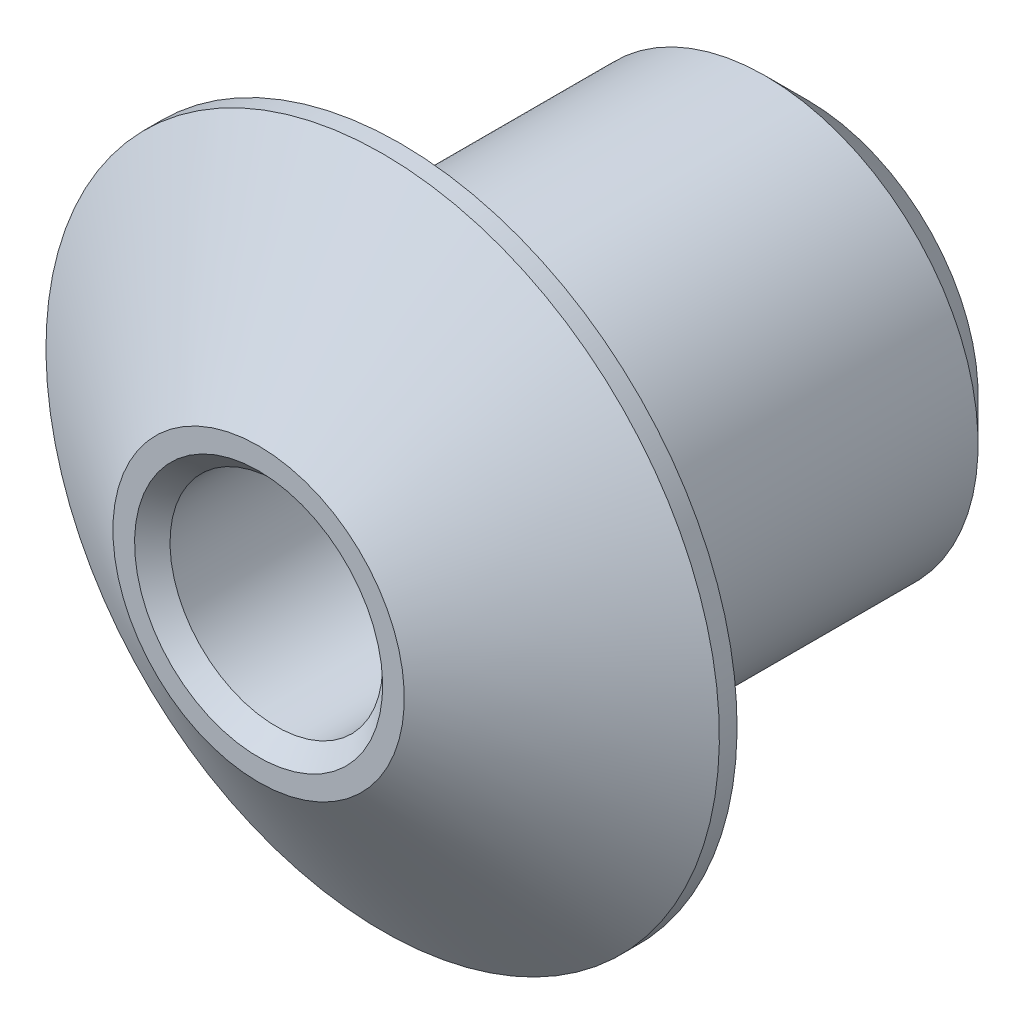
ISO-10303-21;
HEADER;
FILE_DESCRIPTION(('STEP AP214'),'2;1');
FILE_NAME('part.step','',(''),(''),'','','');
FILE_SCHEMA(('AUTOMOTIVE_DESIGN { 1 0 10303 214 1 1 1 1 }'));
ENDSEC;
DATA;
#1=APPLICATION_CONTEXT('core data for automotive mechanical design processes');
#2=APPLICATION_PROTOCOL_DEFINITION('international standard','automotive_design',2000,#1);
#3=PRODUCT_CONTEXT('',#1,'mechanical');
#4=PRODUCT('Part','Part','',(#3));
#5=PRODUCT_RELATED_PRODUCT_CATEGORY('part','',(#4));
#6=PRODUCT_DEFINITION_FORMATION('','',#4);
#7=PRODUCT_DEFINITION_CONTEXT('part definition',#1,'design');
#8=PRODUCT_DEFINITION('design','',#6,#7);
#9=PRODUCT_DEFINITION_SHAPE('','',#8);
#10=(LENGTH_UNIT() NAMED_UNIT(*) SI_UNIT(.MILLI.,.METRE.));
#11=(NAMED_UNIT(*) PLANE_ANGLE_UNIT() SI_UNIT($,.RADIAN.));
#12=(NAMED_UNIT(*) SI_UNIT($,.STERADIAN.) SOLID_ANGLE_UNIT());
#13=UNCERTAINTY_MEASURE_WITH_UNIT(LENGTH_MEASURE(1.E-05),#10,'distance_accuracy_value','');
#14=(GEOMETRIC_REPRESENTATION_CONTEXT(3) GLOBAL_UNCERTAINTY_ASSIGNED_CONTEXT((#13)) GLOBAL_UNIT_ASSIGNED_CONTEXT((#10,
#11,#12)) REPRESENTATION_CONTEXT('',''));
#15=CARTESIAN_POINT('',(0.,0.,0.));
#16=DIRECTION('',(0.,0.,1.));
#17=DIRECTION('',(1.,0.,0.));
#18=AXIS2_PLACEMENT_3D('',#15,#16,#17);
#19=CARTESIAN_POINT('',(0.,0.,-6.));
#20=DIRECTION('',(0.,0.,1.));
#21=DIRECTION('',(0.,-1.,0.));
#22=AXIS2_PLACEMENT_3D('',#19,#20,#21);
#23=CONICAL_SURFACE('',#22,3.,0.872664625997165);
#24=CARTESIAN_POINT('',(2.,2.80471756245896,-5.62679362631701));
#25=CARTESIAN_POINT('',(2.,2.73396986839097,-5.6751166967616));
#26=CARTESIAN_POINT('',(2.,2.66294219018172,-5.72303608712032));
#27=CARTESIAN_POINT('',(2.,2.52019715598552,-5.8178659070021));
#28=CARTESIAN_POINT('',(2.,2.44847966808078,-5.86477613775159));
#29=CARTESIAN_POINT('',(2.,2.30375564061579,-5.95768619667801));
#30=CARTESIAN_POINT('',(2.,2.23074362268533,-6.00367751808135));
#31=CARTESIAN_POINT('',(2.,2.0837722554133,-6.09411502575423));
#32=CARTESIAN_POINT('',(2.,2.00981296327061,-6.13856130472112));
#33=CARTESIAN_POINT('',(2.,1.85599749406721,-6.22831307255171));
#34=CARTESIAN_POINT('',(2.,1.77606682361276,-6.2734915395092));
#35=CARTESIAN_POINT('',(2.,1.6146904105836,-6.36105190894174));
#36=CARTESIAN_POINT('',(2.,1.53324484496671,-6.4034341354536));
#37=CARTESIAN_POINT('',(2.,1.36876230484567,-6.48447917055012));
#38=CARTESIAN_POINT('',(2.,1.28572983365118,-6.52315104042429));
#39=CARTESIAN_POINT('',(2.,1.11764806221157,-6.59578804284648));
#40=CARTESIAN_POINT('',(2.,1.03259966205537,-6.6297552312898));
#41=CARTESIAN_POINT('',(2.,0.864533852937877,-6.69007539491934));
#42=CARTESIAN_POINT('',(2.,0.781623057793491,-6.71672121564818));
#43=CARTESIAN_POINT('',(2.,0.613855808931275,-6.76308753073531));
#44=CARTESIAN_POINT('',(2.,0.528999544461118,-6.78280869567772));
#45=CARTESIAN_POINT('',(2.,0.359526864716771,-6.81358148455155));
#46=CARTESIAN_POINT('',(2.,0.27494250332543,-6.82480568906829));
#47=CARTESIAN_POINT('',(2.,0.105054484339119,-6.83828208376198));
#48=CARTESIAN_POINT('',(2.,0.0197509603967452,-6.84053590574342));
#49=CARTESIAN_POINT('',(2.,-0.142921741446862,-6.83607840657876));
#50=CARTESIAN_POINT('',(2.,-0.220314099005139,-6.83015563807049));
#51=CARTESIAN_POINT('',(2.,-0.374206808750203,-6.81117313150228));
#52=CARTESIAN_POINT('',(2.,-0.450707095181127,-6.79811287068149));
#53=CARTESIAN_POINT('',(2.,-0.60406442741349,-6.76535582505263));
#54=CARTESIAN_POINT('',(2.,-0.680890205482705,-6.74551522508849));
#55=CARTESIAN_POINT('',(2.,-0.83287627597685,-6.70037508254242));
#56=CARTESIAN_POINT('',(2.,-0.908036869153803,-6.6750765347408));
#57=CARTESIAN_POINT('',(2.,-1.12321598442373,-6.59549140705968));
#58=CARTESIAN_POINT('',(2.,-1.26111796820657,-6.53551569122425));
#59=CARTESIAN_POINT('',(2.,-1.53207254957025,-6.40534956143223));
#60=CARTESIAN_POINT('',(2.,-1.6651177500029,-6.33514431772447));
#61=CARTESIAN_POINT('',(2.,-1.928255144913,-6.18759917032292));
#62=CARTESIAN_POINT('',(2.,-2.05832345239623,-6.11021710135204));
#63=CARTESIAN_POINT('',(2.,-2.31553327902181,-5.95094559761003));
#64=CARTESIAN_POINT('',(2.,-2.44267647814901,-5.86905884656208));
#65=CARTESIAN_POINT('',(2.,-2.68110139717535,-5.71119615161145));
#66=CARTESIAN_POINT('',(2.,-2.79260172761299,-5.6355485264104));
#67=CARTESIAN_POINT('',(2.,-3.01430589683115,-5.48234503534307));
#68=CARTESIAN_POINT('',(2.,-3.12450952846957,-5.40478887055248));
#69=CARTESIAN_POINT('',(2.,-3.3424096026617,-5.24928281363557));
#70=CARTESIAN_POINT('',(2.,-3.45011984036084,-5.17135219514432));
#71=CARTESIAN_POINT('',(2.,-3.66469498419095,-5.01439381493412));
#72=CARTESIAN_POINT('',(2.,-3.77156010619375,-4.93536634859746));
#73=CARTESIAN_POINT('',(2.,-3.87811170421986,-4.85592436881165));
#74=B_SPLINE_CURVE_WITH_KNOTS('',3,(#24,#25,#26,#27,#28,#29,#30,#31,#32,#33,#34,#35,#36,#37,#38,
#39,#40,#41,#42,#43,#44,#45,#46,#47,#48,#49,#50,#51,#52,#53,#54,#55,#56,#57,#58,#59,#60,#61,#62,
#63,#64,#65,#66,#67,#68,#69,#70,#71,#72,#73),.UNSPECIFIED.,.F.,.F.,(4,2,2,2,2,2,2,2,2,2,2,2,2,2,
2,2,2,2,2,2,2,2,2,2,4),(0.,0.257031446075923,0.51411306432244,0.772967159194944,
1.03180569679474,1.30720772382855,1.58257778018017,1.85725724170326,2.13181628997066,
2.39283817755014,2.6538347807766,2.90937650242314,3.16487173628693,3.39737401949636,
3.62989333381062,3.86768683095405,4.10543702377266,4.55583321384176,5.00688896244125,
5.46078660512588,5.91441670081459,6.31861250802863,6.72287203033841,7.12170276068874,
7.5204280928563),.UNSPECIFIED.);
#75=CARTESIAN_POINT('',(2.,1.15470053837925,-6.57948130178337));
#76=VERTEX_POINT('',#75);
#77=CARTESIAN_POINT('',(2.,-1.15470053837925,-6.57948130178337));
#78=VERTEX_POINT('',#77);
#79=EDGE_CURVE('E142',#76,#78,#74,.T.);
#80=ORIENTED_EDGE('',*,*,#79,.T.);
#81=CARTESIAN_POINT('',(2.0002,-1.15458506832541,-6.57938440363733));
#82=CARTESIAN_POINT('',(1.93287475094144,-1.19345531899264,-6.61198832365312));
#83=CARTESIAN_POINT('',(1.86472971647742,-1.23279887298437,-6.64255441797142));
#84=CARTESIAN_POINT('',(1.72660712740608,-1.31254398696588,-6.6984348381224));
#85=CARTESIAN_POINT('',(1.65662434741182,-1.3529485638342,-6.72373181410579));
#86=CARTESIAN_POINT('',(1.51571866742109,-1.4343004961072,-6.76746867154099));
#87=CARTESIAN_POINT('',(1.44481025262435,-1.47523948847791,-6.78596924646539));
#88=CARTESIAN_POINT('',(1.30186028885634,-1.55777168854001,-6.81514647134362));
#89=CARTESIAN_POINT('',(1.22982023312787,-1.59936403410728,-6.82583267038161));
#90=CARTESIAN_POINT('',(1.0839081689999,-1.68360640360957,-6.83863007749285));
#91=CARTESIAN_POINT('',(1.01002594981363,-1.7262623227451,-6.84059082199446));
#92=CARTESIAN_POINT('',(0.862481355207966,-1.81144723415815,-6.83533603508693));
#93=CARTESIAN_POINT('',(0.78881909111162,-1.8539761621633,-6.82811645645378));
#94=CARTESIAN_POINT('',(0.642524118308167,-1.93843960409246,-6.80516008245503));
#95=CARTESIAN_POINT('',(0.569891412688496,-1.98037411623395,-6.7894232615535));
#96=CARTESIAN_POINT('',(0.42609953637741,-2.06339239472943,-6.75064484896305));
#97=CARTESIAN_POINT('',(0.354941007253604,-2.1044757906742,-6.72760014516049));
#98=CARTESIAN_POINT('',(0.236290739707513,-2.17297855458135,-6.68371678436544));
#99=CARTESIAN_POINT('',(0.188354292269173,-2.20065467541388,-6.66444042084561));
#100=CARTESIAN_POINT('',(0.0934234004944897,-2.2554630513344,-6.62356259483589));
#101=CARTESIAN_POINT('',(0.0464262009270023,-2.28259689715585,-6.60196969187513));
#102=CARTESIAN_POINT('',(-0.000200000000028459,-2.30951654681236,-6.57938440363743));
#103=B_SPLINE_CURVE_WITH_KNOTS('',3,(#81,#82,#83,#84,#85,#86,#87,#88,#89,#90,#91,#92,#93,#94,
#95,#96,#97,#98,#99,#100,#101,#102),.UNSPECIFIED.,.F.,.F.,(4,2,2,2,2,2,2,2,2,2,4),(0.,
0.253000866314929,0.506822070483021,0.758318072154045,1.00950623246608,1.2650095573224,
1.5206255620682,1.77624233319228,2.0319681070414,2.20775392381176,2.38291123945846),.UNSPECIFIED.);
#104=CARTESIAN_POINT('',(0.,-2.30940107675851,-6.57948130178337));
#105=VERTEX_POINT('',#104);
#106=EDGE_CURVE('E104',#78,#105,#103,.T.);
#107=ORIENTED_EDGE('',*,*,#106,.T.);
#108=CARTESIAN_POINT('',(0.0002,-2.30951654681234,-6.57938440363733));
#109=CARTESIAN_POINT('',(-0.0671252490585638,-2.27064629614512,-6.61198832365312));
#110=CARTESIAN_POINT('',(-0.135270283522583,-2.23130274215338,-6.64255441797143));
#111=CARTESIAN_POINT('',(-0.273392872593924,-2.15155762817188,-6.6984348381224));
#112=CARTESIAN_POINT('',(-0.343375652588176,-2.11115305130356,-6.72373181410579));
#113=CARTESIAN_POINT('',(-0.484281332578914,-2.02980111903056,-6.76746867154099));
#114=CARTESIAN_POINT('',(-0.555189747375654,-1.98886212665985,-6.78596924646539));
#115=CARTESIAN_POINT('',(-0.698139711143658,-1.90632992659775,-6.81514647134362));
#116=CARTESIAN_POINT('',(-0.770179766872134,-1.86473758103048,-6.82583267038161));
#117=CARTESIAN_POINT('',(-0.9160918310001,-1.78049521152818,-6.83863007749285));
#118=CARTESIAN_POINT('',(-0.98997405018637,-1.73783929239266,-6.84059082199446));
#119=CARTESIAN_POINT('',(-1.13751864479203,-1.6526543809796,-6.83533603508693));
#120=CARTESIAN_POINT('',(-1.21118090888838,-1.61012545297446,-6.82811645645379));
#121=CARTESIAN_POINT('',(-1.35747588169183,-1.5256620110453,-6.80516008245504));
#122=CARTESIAN_POINT('',(-1.43010858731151,-1.48372749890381,-6.7894232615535));
#123=CARTESIAN_POINT('',(-1.57390046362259,-1.40070922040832,-6.75064484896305));
#124=CARTESIAN_POINT('',(-1.64505899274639,-1.35962582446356,-6.72760014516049));
#125=CARTESIAN_POINT('',(-1.76370926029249,-1.2911230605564,-6.68371678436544));
#126=CARTESIAN_POINT('',(-1.81164570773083,-1.26344693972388,-6.66444042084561));
#127=CARTESIAN_POINT('',(-1.90657659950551,-1.20863856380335,-6.62356259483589));
#128=CARTESIAN_POINT('',(-1.953573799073,-1.18150471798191,-6.60196969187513));
#129=CARTESIAN_POINT('',(-2.00020000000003,-1.1545850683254,-6.57938440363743));
#130=B_SPLINE_CURVE_WITH_KNOTS('',3,(#108,#109,#110,#111,#112,#113,#114,#115,#116,#117,#118,
#119,#120,#121,#122,#123,#124,#125,#126,#127,#128,#129),.UNSPECIFIED.,.F.,.F.,(4,2,2,2,2,2,2,2,
2,2,4),(0.,0.253000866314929,0.506822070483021,0.758318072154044,1.00950623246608,
1.2650095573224,1.52062556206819,1.77624233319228,2.0319681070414,2.20775392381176,
2.38291123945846),.UNSPECIFIED.);
#131=CARTESIAN_POINT('',(-2.,-1.15470053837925,-6.57948130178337));
#132=VERTEX_POINT('',#131);
#133=EDGE_CURVE('E153',#105,#132,#130,.T.);
#134=ORIENTED_EDGE('',*,*,#133,.T.);
#135=CARTESIAN_POINT('',(-2.,2.80471756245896,-5.62679362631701));
#136=CARTESIAN_POINT('',(-2.,2.73396986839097,-5.6751166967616));
#137=CARTESIAN_POINT('',(-2.,2.66294219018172,-5.72303608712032));
#138=CARTESIAN_POINT('',(-2.,2.52019715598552,-5.8178659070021));
#139=CARTESIAN_POINT('',(-2.,2.44847966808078,-5.86477613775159));
#140=CARTESIAN_POINT('',(-2.,2.30375564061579,-5.95768619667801));
#141=CARTESIAN_POINT('',(-2.,2.23074362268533,-6.00367751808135));
#142=CARTESIAN_POINT('',(-2.,2.0837722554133,-6.09411502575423));
#143=CARTESIAN_POINT('',(-2.,2.00981296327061,-6.13856130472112));
#144=CARTESIAN_POINT('',(-2.,1.85599749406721,-6.22831307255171));
#145=CARTESIAN_POINT('',(-2.,1.77606682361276,-6.2734915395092));
#146=CARTESIAN_POINT('',(-2.,1.6146904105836,-6.36105190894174));
#147=CARTESIAN_POINT('',(-2.,1.53324484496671,-6.4034341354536));
#148=CARTESIAN_POINT('',(-2.,1.36876230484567,-6.48447917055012));
#149=CARTESIAN_POINT('',(-2.,1.28572983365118,-6.52315104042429));
#150=CARTESIAN_POINT('',(-2.,1.11764806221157,-6.59578804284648));
#151=CARTESIAN_POINT('',(-2.,1.03259966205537,-6.6297552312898));
#152=CARTESIAN_POINT('',(-2.,0.864533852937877,-6.69007539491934));
#153=CARTESIAN_POINT('',(-2.,0.781623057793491,-6.71672121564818));
#154=CARTESIAN_POINT('',(-2.,0.613855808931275,-6.76308753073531));
#155=CARTESIAN_POINT('',(-2.,0.528999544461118,-6.78280869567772));
#156=CARTESIAN_POINT('',(-2.,0.359526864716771,-6.81358148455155));
#157=CARTESIAN_POINT('',(-2.,0.27494250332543,-6.82480568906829));
#158=CARTESIAN_POINT('',(-2.,0.105054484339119,-6.83828208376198));
#159=CARTESIAN_POINT('',(-2.,0.0197509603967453,-6.84053590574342));
#160=CARTESIAN_POINT('',(-2.,-0.142921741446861,-6.83607840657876));
#161=CARTESIAN_POINT('',(-2.,-0.220314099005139,-6.83015563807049));
#162=CARTESIAN_POINT('',(-2.,-0.374206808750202,-6.81117313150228));
#163=CARTESIAN_POINT('',(-2.,-0.450707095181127,-6.79811287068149));
#164=CARTESIAN_POINT('',(-2.,-0.60406442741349,-6.76535582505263));
#165=CARTESIAN_POINT('',(-2.,-0.680890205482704,-6.7455152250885));
#166=CARTESIAN_POINT('',(-2.,-0.832876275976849,-6.70037508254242));
#167=CARTESIAN_POINT('',(-2.,-0.908036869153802,-6.6750765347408));
#168=CARTESIAN_POINT('',(-2.,-1.12321598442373,-6.59549140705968));
#169=CARTESIAN_POINT('',(-2.,-1.26111796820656,-6.53551569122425));
#170=CARTESIAN_POINT('',(-2.,-1.53207254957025,-6.40534956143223));
#171=CARTESIAN_POINT('',(-2.,-1.6651177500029,-6.33514431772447));
#172=CARTESIAN_POINT('',(-2.,-1.928255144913,-6.18759917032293));
#173=CARTESIAN_POINT('',(-2.,-2.05832345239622,-6.11021710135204));
#174=CARTESIAN_POINT('',(-2.,-2.3155332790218,-5.95094559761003));
#175=CARTESIAN_POINT('',(-2.,-2.442676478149,-5.86905884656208));
#176=CARTESIAN_POINT('',(-2.,-2.68110139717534,-5.71119615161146));
#177=CARTESIAN_POINT('',(-2.,-2.79260172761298,-5.6355485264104));
#178=CARTESIAN_POINT('',(-2.,-3.01430589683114,-5.48234503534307));
#179=CARTESIAN_POINT('',(-2.,-3.12450952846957,-5.40478887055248));
#180=CARTESIAN_POINT('',(-2.,-3.3424096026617,-5.24928281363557));
#181=CARTESIAN_POINT('',(-2.,-3.45011984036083,-5.17135219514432));
#182=CARTESIAN_POINT('',(-2.,-3.66469498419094,-5.01439381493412));
#183=CARTESIAN_POINT('',(-2.,-3.77156010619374,-4.93536634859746));
#184=CARTESIAN_POINT('',(-2.,-3.87811170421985,-4.85592436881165));
#185=B_SPLINE_CURVE_WITH_KNOTS('',3,(#135,#136,#137,#138,#139,#140,#141,#142,#143,#144,#145,
#146,#147,#148,#149,#150,#151,#152,#153,#154,#155,#156,#157,#158,#159,#160,#161,#162,#163,#164,
#165,#166,#167,#168,#169,#170,#171,#172,#173,#174,#175,#176,#177,#178,#179,#180,#181,#182,#183,
#184),.UNSPECIFIED.,.F.,.F.,(4,2,2,2,2,2,2,2,2,2,2,2,2,2,2,2,2,2,2,2,2,2,2,2,4),(0.,
0.257031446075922,0.51411306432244,0.772967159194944,1.03180569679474,1.30720772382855,
1.58257778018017,1.85725724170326,2.13181628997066,2.39283817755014,2.6538347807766,
2.90937650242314,3.16487173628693,3.39737401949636,3.62989333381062,3.86768683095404,
4.10543702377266,4.55583321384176,5.00688896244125,5.46078660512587,5.91441670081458,
6.31861250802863,6.72287203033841,7.12170276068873,7.52042809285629),.UNSPECIFIED.);
#186=CARTESIAN_POINT('',(-2.,1.15470053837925,-6.57948130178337));
#187=VERTEX_POINT('',#186);
#188=EDGE_CURVE('E78',#132,#187,#185,.F.);
#189=ORIENTED_EDGE('',*,*,#188,.T.);
#190=CARTESIAN_POINT('',(-2.0002,1.15458506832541,-6.57938440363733));
#191=CARTESIAN_POINT('',(-1.93287475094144,1.19345531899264,-6.61198832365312));
#192=CARTESIAN_POINT('',(-1.86472971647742,1.23279887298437,-6.64255441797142));
#193=CARTESIAN_POINT('',(-1.72660712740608,1.31254398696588,-6.6984348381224));
#194=CARTESIAN_POINT('',(-1.65662434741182,1.3529485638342,-6.72373181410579));
#195=CARTESIAN_POINT('',(-1.51571866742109,1.4343004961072,-6.76746867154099));
#196=CARTESIAN_POINT('',(-1.44481025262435,1.47523948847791,-6.78596924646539));
#197=CARTESIAN_POINT('',(-1.30186028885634,1.55777168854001,-6.81514647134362));
#198=CARTESIAN_POINT('',(-1.22982023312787,1.59936403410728,-6.82583267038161));
#199=CARTESIAN_POINT('',(-1.0839081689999,1.68360640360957,-6.83863007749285));
#200=CARTESIAN_POINT('',(-1.01002594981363,1.7262623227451,-6.84059082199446));
#201=CARTESIAN_POINT('',(-0.862481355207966,1.81144723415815,-6.83533603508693));
#202=CARTESIAN_POINT('',(-0.78881909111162,1.8539761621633,-6.82811645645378));
#203=CARTESIAN_POINT('',(-0.642524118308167,1.93843960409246,-6.80516008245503));
#204=CARTESIAN_POINT('',(-0.569891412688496,1.98037411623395,-6.7894232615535));
#205=CARTESIAN_POINT('',(-0.42609953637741,2.06339239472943,-6.75064484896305));
#206=CARTESIAN_POINT('',(-0.354941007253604,2.1044757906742,-6.72760014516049));
#207=CARTESIAN_POINT('',(-0.236290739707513,2.17297855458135,-6.68371678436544));
#208=CARTESIAN_POINT('',(-0.188354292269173,2.20065467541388,-6.66444042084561));
#209=CARTESIAN_POINT('',(-0.0934234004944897,2.2554630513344,-6.62356259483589));
#210=CARTESIAN_POINT('',(-0.0464262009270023,2.28259689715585,-6.60196969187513));
#211=CARTESIAN_POINT('',(0.000200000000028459,2.30951654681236,-6.57938440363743));
#212=B_SPLINE_CURVE_WITH_KNOTS('',3,(#190,#191,#192,#193,#194,#195,#196,#197,#198,#199,#200,
#201,#202,#203,#204,#205,#206,#207,#208,#209,#210,#211),.UNSPECIFIED.,.F.,.F.,(4,2,2,2,2,2,2,2,
2,2,4),(0.,0.253000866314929,0.506822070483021,0.758318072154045,1.00950623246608,
1.2650095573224,1.5206255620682,1.77624233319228,2.0319681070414,2.20775392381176,
2.38291123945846),.UNSPECIFIED.);
#213=CARTESIAN_POINT('',(0.,2.30940107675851,-6.57948130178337));
#214=VERTEX_POINT('',#213);
#215=EDGE_CURVE('E29',#187,#214,#212,.T.);
#216=ORIENTED_EDGE('',*,*,#215,.T.);
#217=CARTESIAN_POINT('',(-0.0002,2.30951654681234,-6.57938440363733));
#218=CARTESIAN_POINT('',(0.0671252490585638,2.27064629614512,-6.61198832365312));
#219=CARTESIAN_POINT('',(0.135270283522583,2.23130274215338,-6.64255441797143));
#220=CARTESIAN_POINT('',(0.273392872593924,2.15155762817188,-6.6984348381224));
#221=CARTESIAN_POINT('',(0.343375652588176,2.11115305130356,-6.72373181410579));
#222=CARTESIAN_POINT('',(0.484281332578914,2.02980111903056,-6.76746867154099));
#223=CARTESIAN_POINT('',(0.555189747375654,1.98886212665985,-6.78596924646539));
#224=CARTESIAN_POINT('',(0.698139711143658,1.90632992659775,-6.81514647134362));
#225=CARTESIAN_POINT('',(0.770179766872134,1.86473758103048,-6.82583267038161));
#226=CARTESIAN_POINT('',(0.9160918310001,1.78049521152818,-6.83863007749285));
#227=CARTESIAN_POINT('',(0.98997405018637,1.73783929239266,-6.84059082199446));
#228=CARTESIAN_POINT('',(1.13751864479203,1.6526543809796,-6.83533603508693));
#229=CARTESIAN_POINT('',(1.21118090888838,1.61012545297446,-6.82811645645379));
#230=CARTESIAN_POINT('',(1.35747588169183,1.5256620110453,-6.80516008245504));
#231=CARTESIAN_POINT('',(1.43010858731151,1.48372749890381,-6.7894232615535));
#232=CARTESIAN_POINT('',(1.57390046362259,1.40070922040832,-6.75064484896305));
#233=CARTESIAN_POINT('',(1.64505899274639,1.35962582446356,-6.72760014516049));
#234=CARTESIAN_POINT('',(1.76370926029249,1.2911230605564,-6.68371678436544));
#235=CARTESIAN_POINT('',(1.81164570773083,1.26344693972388,-6.66444042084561));
#236=CARTESIAN_POINT('',(1.90657659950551,1.20863856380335,-6.62356259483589));
#237=CARTESIAN_POINT('',(1.953573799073,1.18150471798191,-6.60196969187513));
#238=CARTESIAN_POINT('',(2.00020000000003,1.1545850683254,-6.57938440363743));
#239=B_SPLINE_CURVE_WITH_KNOTS('',3,(#217,#218,#219,#220,#221,#222,#223,#224,#225,#226,#227,
#228,#229,#230,#231,#232,#233,#234,#235,#236,#237,#238),.UNSPECIFIED.,.F.,.F.,(4,2,2,2,2,2,2,2,
2,2,4),(0.,0.253000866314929,0.506822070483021,0.758318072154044,1.00950623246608,
1.2650095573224,1.52062556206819,1.77624233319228,2.0319681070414,2.20775392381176,
2.38291123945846),.UNSPECIFIED.);
#240=EDGE_CURVE('E121',#214,#76,#239,.T.);
#241=ORIENTED_EDGE('',*,*,#240,.T.);
#242=EDGE_LOOP('',(#80,#107,#134,#189,#216,#241));
#243=FACE_BOUND('',#242,.T.);
#244=CARTESIAN_POINT('',(0.,0.,-6.));
#245=DIRECTION('',(0.,0.,-1.));
#246=DIRECTION('',(0.,1.,0.));
#247=AXIS2_PLACEMENT_3D('',#244,#245,#246);
#248=CIRCLE('',#247,3.);
#249=CARTESIAN_POINT('',(0.,3.,-6.));
#250=VERTEX_POINT('',#249);
#251=EDGE_CURVE('E214',#250,#250,#248,.T.);
#252=ORIENTED_EDGE('',*,*,#251,.F.);
#253=EDGE_LOOP('',(#252));
#254=FACE_BOUND('',#253,.T.);
#255=ADVANCED_FACE('F14',(#243,#254),#23,.F.);
#256=CARTESIAN_POINT('',(2.,0.,-11.5));
#257=DIRECTION('',(0.,0.,-1.));
#258=DIRECTION('',(0.,1.,0.));
#259=AXIS2_PLACEMENT_3D('',#256,#257,#258);
#260=PLANE('',#259);
#261=CARTESIAN_POINT('',(0.,0.,-11.5));
#262=DIRECTION('',(0.,0.,-1.));
#263=DIRECTION('',(0.,1.,0.));
#264=AXIS2_PLACEMENT_3D('',#261,#262,#263);
#265=CIRCLE('',#264,4.8);
#266=CARTESIAN_POINT('',(0.,4.8,-11.5));
#267=VERTEX_POINT('',#266);
#268=EDGE_CURVE('E88',#267,#267,#265,.T.);
#269=ORIENTED_EDGE('',*,*,#268,.T.);
#270=EDGE_LOOP('',(#269));
#271=FACE_BOUND('',#270,.T.);
#272=DIRECTION('',(-0.866025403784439,-0.5,0.));
#273=VECTOR('',#272,1.);
#274=CARTESIAN_POINT('',(0.5,2.59807621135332,-11.5));
#275=LINE('',#274,#273);
#276=CARTESIAN_POINT('',(0.,2.30940107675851,-11.5));
#277=VERTEX_POINT('',#276);
#278=CARTESIAN_POINT('',(-2.,1.15470053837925,-11.5));
#279=VERTEX_POINT('',#278);
#280=EDGE_CURVE('E83',#277,#279,#275,.T.);
#281=ORIENTED_EDGE('',*,*,#280,.T.);
#282=DIRECTION('',(0.,-1.,0.));
#283=VECTOR('',#282,1.);
#284=CARTESIAN_POINT('',(-2.,0.,-11.5));
#285=LINE('',#284,#283);
#286=CARTESIAN_POINT('',(-2.,-1.15470053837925,-11.5));
#287=VERTEX_POINT('',#286);
#288=EDGE_CURVE('E9',#279,#287,#285,.T.);
#289=ORIENTED_EDGE('',*,*,#288,.T.);
#290=DIRECTION('',(0.866025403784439,-0.5,0.));
#291=VECTOR('',#290,1.);
#292=CARTESIAN_POINT('',(0.5,-2.59807621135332,-11.5));
#293=LINE('',#292,#291);
#294=CARTESIAN_POINT('',(0.,-2.30940107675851,-11.5));
#295=VERTEX_POINT('',#294);
#296=EDGE_CURVE('E22',#287,#295,#293,.T.);
#297=ORIENTED_EDGE('',*,*,#296,.T.);
#298=DIRECTION('',(0.866025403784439,0.5,0.));
#299=VECTOR('',#298,1.);
#300=CARTESIAN_POINT('',(2.5,-0.866025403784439,-11.5));
#301=LINE('',#300,#299);
#302=CARTESIAN_POINT('',(2.,-1.15470053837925,-11.5));
#303=VERTEX_POINT('',#302);
#304=EDGE_CURVE('E75',#295,#303,#301,.T.);
#305=ORIENTED_EDGE('',*,*,#304,.T.);
#306=DIRECTION('',(0.,1.,0.));
#307=VECTOR('',#306,1.);
#308=CARTESIAN_POINT('',(2.,0.,-11.5));
#309=LINE('',#308,#307);
#310=CARTESIAN_POINT('',(2.,1.15470053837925,-11.5));
#311=VERTEX_POINT('',#310);
#312=EDGE_CURVE('E90',#303,#311,#309,.T.);
#313=ORIENTED_EDGE('',*,*,#312,.T.);
#314=DIRECTION('',(-0.866025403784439,0.5,0.));
#315=VECTOR('',#314,1.);
#316=CARTESIAN_POINT('',(2.5,0.866025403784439,-11.5));
#317=LINE('',#316,#315);
#318=EDGE_CURVE('E85',#311,#277,#317,.T.);
#319=ORIENTED_EDGE('',*,*,#318,.T.);
#320=EDGE_LOOP('',(#281,#289,#297,#305,#313,#319));
#321=FACE_BOUND('',#320,.T.);
#322=ADVANCED_FACE('F81',(#271,#321),#260,.T.);
#323=CARTESIAN_POINT('',(0.,0.,-11.5));
#324=DIRECTION('',(0.,0.,1.));
#325=DIRECTION('',(0.,-1.,0.));
#326=AXIS2_PLACEMENT_3D('',#323,#324,#325);
#327=CONICAL_SURFACE('',#326,4.8,0.785398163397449);
#328=CARTESIAN_POINT('',(0.,0.,-10.3));
#329=DIRECTION('',(0.,0.,-1.));
#330=DIRECTION('',(0.,1.,0.));
#331=AXIS2_PLACEMENT_3D('',#328,#329,#330);
#332=CIRCLE('',#331,6.);
#333=CARTESIAN_POINT('',(0.,6.,-10.3));
#334=VERTEX_POINT('',#333);
#335=EDGE_CURVE('E93',#334,#334,#332,.T.);
#336=ORIENTED_EDGE('',*,*,#335,.T.);
#337=EDGE_LOOP('',(#336));
#338=FACE_BOUND('',#337,.T.);
#339=ORIENTED_EDGE('',*,*,#268,.F.);
#340=EDGE_LOOP('',(#339));
#341=FACE_BOUND('',#340,.T.);
#342=ADVANCED_FACE('F197',(#338,#341),#327,.T.);
#343=CARTESIAN_POINT('',(0.,0.,-11.5));
#344=DIRECTION('',(0.,0.,-1.));
#345=DIRECTION('',(0.,1.,0.));
#346=AXIS2_PLACEMENT_3D('',#343,#344,#345);
#347=CYLINDRICAL_SURFACE('',#346,6.);
#348=CARTESIAN_POINT('',(0.,0.,0.));
#349=DIRECTION('',(0.,0.,-1.));
#350=DIRECTION('',(0.,1.,0.));
#351=AXIS2_PLACEMENT_3D('',#348,#349,#350);
#352=CIRCLE('',#351,6.);
#353=CARTESIAN_POINT('',(0.,6.,0.));
#354=VERTEX_POINT('',#353);
#355=EDGE_CURVE('E231',#354,#354,#352,.T.);
#356=ORIENTED_EDGE('',*,*,#355,.T.);
#357=EDGE_LOOP('',(#356));
#358=FACE_BOUND('',#357,.T.);
#359=ORIENTED_EDGE('',*,*,#335,.F.);
#360=EDGE_LOOP('',(#359));
#361=FACE_BOUND('',#360,.T.);
#362=ADVANCED_FACE('F193',(#358,#361),#347,.T.);
#363=CARTESIAN_POINT('',(6.,0.,0.));
#364=DIRECTION('',(0.,0.,-1.));
#365=DIRECTION('',(0.,1.,0.));
#366=AXIS2_PLACEMENT_3D('',#363,#364,#365);
#367=PLANE('',#366);
#368=CARTESIAN_POINT('',(0.,0.,0.));
#369=DIRECTION('',(0.,0.,-1.));
#370=DIRECTION('',(0.,1.,0.));
#371=AXIS2_PLACEMENT_3D('',#368,#369,#370);
#372=CIRCLE('',#371,9.5);
#373=CARTESIAN_POINT('',(0.,9.5,0.));
#374=VERTEX_POINT('',#373);
#375=EDGE_CURVE('E228',#374,#374,#372,.T.);
#376=ORIENTED_EDGE('',*,*,#375,.T.);
#377=EDGE_LOOP('',(#376));
#378=FACE_BOUND('',#377,.T.);
#379=ORIENTED_EDGE('',*,*,#355,.F.);
#380=EDGE_LOOP('',(#379));
#381=FACE_BOUND('',#380,.T.);
#382=ADVANCED_FACE('F189',(#378,#381),#367,.T.);
#383=CARTESIAN_POINT('',(0.,0.,-11.5));
#384=DIRECTION('',(0.,0.,-1.));
#385=DIRECTION('',(0.,1.,0.));
#386=AXIS2_PLACEMENT_3D('',#383,#384,#385);
#387=CYLINDRICAL_SURFACE('',#386,9.5);
#388=CARTESIAN_POINT('',(0.,0.,0.5));
#389=DIRECTION('',(0.,0.,-1.));
#390=DIRECTION('',(0.,1.,0.));
#391=AXIS2_PLACEMENT_3D('',#388,#389,#390);
#392=CIRCLE('',#391,9.5);
#393=CARTESIAN_POINT('',(0.,9.5,0.5));
#394=VERTEX_POINT('',#393);
#395=EDGE_CURVE('E225',#394,#394,#392,.T.);
#396=ORIENTED_EDGE('',*,*,#395,.T.);
#397=EDGE_LOOP('',(#396));
#398=FACE_BOUND('',#397,.T.);
#399=ORIENTED_EDGE('',*,*,#375,.F.);
#400=EDGE_LOOP('',(#399));
#401=FACE_BOUND('',#400,.T.);
#402=ADVANCED_FACE('F185',(#398,#401),#387,.T.);
#403=CARTESIAN_POINT('',(0.,0.,0.5));
#404=DIRECTION('',(0.,0.,-1.));
#405=DIRECTION('',(0.,1.,0.));
#406=AXIS2_PLACEMENT_3D('',#403,#404,#405);
#407=CONICAL_SURFACE('',#406,9.5,0.994837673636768);
#408=CARTESIAN_POINT('',(0.,0.,4.));
#409=DIRECTION('',(0.,0.,-1.));
#410=DIRECTION('',(0.,1.,0.));
#411=AXIS2_PLACEMENT_3D('',#408,#409,#410);
#412=CIRCLE('',#411,4.11047262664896);
#413=CARTESIAN_POINT('',(0.,4.11047262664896,4.));
#414=VERTEX_POINT('',#413);
#415=EDGE_CURVE('E222',#414,#414,#412,.T.);
#416=ORIENTED_EDGE('',*,*,#415,.T.);
#417=EDGE_LOOP('',(#416));
#418=FACE_BOUND('',#417,.T.);
#419=ORIENTED_EDGE('',*,*,#395,.F.);
#420=EDGE_LOOP('',(#419));
#421=FACE_BOUND('',#420,.T.);
#422=ADVANCED_FACE('F181',(#418,#421),#407,.T.);
#423=CARTESIAN_POINT('',(4.11047262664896,0.,4.));
#424=DIRECTION('',(0.,0.,1.));
#425=DIRECTION('',(0.,-1.,0.));
#426=AXIS2_PLACEMENT_3D('',#423,#424,#425);
#427=PLANE('',#426);
#428=CARTESIAN_POINT('',(0.,0.,4.));
#429=DIRECTION('',(0.,0.,-1.));
#430=DIRECTION('',(0.,1.,0.));
#431=AXIS2_PLACEMENT_3D('',#428,#429,#430);
#432=CIRCLE('',#431,3.5);
#433=CARTESIAN_POINT('',(0.,3.5,4.));
#434=VERTEX_POINT('',#433);
#435=EDGE_CURVE('E217',#434,#434,#432,.T.);
#436=ORIENTED_EDGE('',*,*,#435,.T.);
#437=EDGE_LOOP('',(#436));
#438=FACE_BOUND('',#437,.T.);
#439=ORIENTED_EDGE('',*,*,#415,.F.);
#440=EDGE_LOOP('',(#439));
#441=FACE_BOUND('',#440,.T.);
#442=ADVANCED_FACE('F177',(#438,#441),#427,.T.);
#443=CARTESIAN_POINT('',(0.,0.,4.));
#444=DIRECTION('',(0.,0.,1.));
#445=DIRECTION('',(0.,-1.,0.));
#446=AXIS2_PLACEMENT_3D('',#443,#444,#445);
#447=CONICAL_SURFACE('',#446,3.5,0.785398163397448);
#448=CARTESIAN_POINT('',(0.,0.,3.5));
#449=DIRECTION('',(0.,0.,-1.));
#450=DIRECTION('',(0.,1.,0.));
#451=AXIS2_PLACEMENT_3D('',#448,#449,#450);
#452=CIRCLE('',#451,3.);
#453=CARTESIAN_POINT('',(0.,3.,3.5));
#454=VERTEX_POINT('',#453);
#455=EDGE_CURVE('E215',#454,#454,#452,.T.);
#456=ORIENTED_EDGE('',*,*,#455,.T.);
#457=EDGE_LOOP('',(#456));
#458=FACE_BOUND('',#457,.T.);
#459=ORIENTED_EDGE('',*,*,#435,.F.);
#460=EDGE_LOOP('',(#459));
#461=FACE_BOUND('',#460,.T.);
#462=ADVANCED_FACE('F173',(#458,#461),#447,.F.);
#463=CARTESIAN_POINT('',(0.,0.,-11.5));
#464=DIRECTION('',(0.,0.,-1.));
#465=DIRECTION('',(0.,1.,0.));
#466=AXIS2_PLACEMENT_3D('',#463,#464,#465);
#467=CYLINDRICAL_SURFACE('',#466,3.);
#468=ORIENTED_EDGE('',*,*,#251,.T.);
#469=EDGE_LOOP('',(#468));
#470=FACE_BOUND('',#469,.T.);
#471=ORIENTED_EDGE('',*,*,#455,.F.);
#472=EDGE_LOOP('',(#471));
#473=FACE_BOUND('',#472,.T.);
#474=ADVANCED_FACE('F170',(#470,#473),#467,.F.);
#475=CARTESIAN_POINT('',(-2.,1.15470053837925,-6.));
#476=DIRECTION('',(1.,0.,0.));
#477=DIRECTION('',(0.,1.,0.));
#478=AXIS2_PLACEMENT_3D('',#475,#476,#477);
#479=PLANE('',#478);
#480=DIRECTION('',(0.,0.,-1.));
#481=VECTOR('',#480,1.);
#482=CARTESIAN_POINT('',(-2.,-1.15470053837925,-6.));
#483=LINE('',#482,#481);
#484=EDGE_CURVE('E70',#132,#287,#483,.T.);
#485=ORIENTED_EDGE('',*,*,#484,.T.);
#486=ORIENTED_EDGE('',*,*,#288,.F.);
#487=DIRECTION('',(0.,0.,-1.));
#488=VECTOR('',#487,1.);
#489=CARTESIAN_POINT('',(-2.,1.15470053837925,-6.));
#490=LINE('',#489,#488);
#491=EDGE_CURVE('E246',#187,#279,#490,.T.);
#492=ORIENTED_EDGE('',*,*,#491,.F.);
#493=ORIENTED_EDGE('',*,*,#188,.F.);
#494=EDGE_LOOP('',(#485,#486,#492,#493));
#495=FACE_BOUND('',#494,.T.);
#496=ADVANCED_FACE('F77',(#495),#479,.T.);
#497=CARTESIAN_POINT('',(-2.,-1.15470053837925,-6.));
#498=DIRECTION('',(0.5,0.866025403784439,0.));
#499=DIRECTION('',(-0.866025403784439,0.5,0.));
#500=AXIS2_PLACEMENT_3D('',#497,#498,#499);
#501=PLANE('',#500);
#502=DIRECTION('',(0.,0.,-1.));
#503=VECTOR('',#502,1.);
#504=CARTESIAN_POINT('',(0.,-2.30940107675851,-6.));
#505=LINE('',#504,#503);
#506=EDGE_CURVE('E72',#105,#295,#505,.T.);
#507=ORIENTED_EDGE('',*,*,#506,.T.);
#508=ORIENTED_EDGE('',*,*,#296,.F.);
#509=ORIENTED_EDGE('',*,*,#484,.F.);
#510=ORIENTED_EDGE('',*,*,#133,.F.);
#511=EDGE_LOOP('',(#507,#508,#509,#510));
#512=FACE_BOUND('',#511,.T.);
#513=ADVANCED_FACE('F68',(#512),#501,.T.);
#514=CARTESIAN_POINT('',(0.,-2.30940107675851,-6.));
#515=DIRECTION('',(-0.5,0.866025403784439,0.));
#516=DIRECTION('',(-0.866025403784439,-0.5,0.));
#517=AXIS2_PLACEMENT_3D('',#514,#515,#516);
#518=PLANE('',#517);
#519=DIRECTION('',(0.,0.,-1.));
#520=VECTOR('',#519,1.);
#521=CARTESIAN_POINT('',(2.,-1.15470053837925,-6.));
#522=LINE('',#521,#520);
#523=EDGE_CURVE('E103',#78,#303,#522,.T.);
#524=ORIENTED_EDGE('',*,*,#523,.T.);
#525=ORIENTED_EDGE('',*,*,#304,.F.);
#526=ORIENTED_EDGE('',*,*,#506,.F.);
#527=ORIENTED_EDGE('',*,*,#106,.F.);
#528=EDGE_LOOP('',(#524,#525,#526,#527));
#529=FACE_BOUND('',#528,.T.);
#530=ADVANCED_FACE('F100',(#529),#518,.T.);
#531=CARTESIAN_POINT('',(2.,-1.15470053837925,-6.));
#532=DIRECTION('',(-1.,0.,0.));
#533=DIRECTION('',(0.,-1.,0.));
#534=AXIS2_PLACEMENT_3D('',#531,#532,#533);
#535=PLANE('',#534);
#536=DIRECTION('',(0.,0.,-1.));
#537=VECTOR('',#536,1.);
#538=CARTESIAN_POINT('',(2.,1.15470053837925,-6.));
#539=LINE('',#538,#537);
#540=EDGE_CURVE('E107',#76,#311,#539,.T.);
#541=ORIENTED_EDGE('',*,*,#540,.T.);
#542=ORIENTED_EDGE('',*,*,#312,.F.);
#543=ORIENTED_EDGE('',*,*,#523,.F.);
#544=ORIENTED_EDGE('',*,*,#79,.F.);
#545=EDGE_LOOP('',(#541,#542,#543,#544));
#546=FACE_BOUND('',#545,.T.);
#547=ADVANCED_FACE('F135',(#546),#535,.T.);
#548=CARTESIAN_POINT('',(2.,1.15470053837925,-6.));
#549=DIRECTION('',(-0.5,-0.866025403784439,0.));
#550=DIRECTION('',(0.866025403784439,-0.5,0.));
#551=AXIS2_PLACEMENT_3D('',#548,#549,#550);
#552=PLANE('',#551);
#553=DIRECTION('',(0.,0.,-1.));
#554=VECTOR('',#553,1.);
#555=CARTESIAN_POINT('',(0.,2.30940107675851,-6.));
#556=LINE('',#555,#554);
#557=EDGE_CURVE('E111',#214,#277,#556,.T.);
#558=ORIENTED_EDGE('',*,*,#557,.T.);
#559=ORIENTED_EDGE('',*,*,#318,.F.);
#560=ORIENTED_EDGE('',*,*,#540,.F.);
#561=ORIENTED_EDGE('',*,*,#240,.F.);
#562=EDGE_LOOP('',(#558,#559,#560,#561));
#563=FACE_BOUND('',#562,.T.);
#564=ADVANCED_FACE('F131',(#563),#552,.T.);
#565=CARTESIAN_POINT('',(0.,2.30940107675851,-6.));
#566=DIRECTION('',(0.5,-0.866025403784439,0.));
#567=DIRECTION('',(0.866025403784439,0.5,0.));
#568=AXIS2_PLACEMENT_3D('',#565,#566,#567);
#569=PLANE('',#568);
#570=ORIENTED_EDGE('',*,*,#491,.T.);
#571=ORIENTED_EDGE('',*,*,#280,.F.);
#572=ORIENTED_EDGE('',*,*,#557,.F.);
#573=ORIENTED_EDGE('',*,*,#215,.F.);
#574=EDGE_LOOP('',(#570,#571,#572,#573));
#575=FACE_BOUND('',#574,.T.);
#576=ADVANCED_FACE('F128',(#575),#569,.T.);
#577=CLOSED_SHELL('',(#255,#322,#342,#362,#382,#402,#422,#442,#462,#474,#496,#513,#530,#547,
#564,#576));
#578=MANIFOLD_SOLID_BREP('B1',#577);
#579=ADVANCED_BREP_SHAPE_REPRESENTATION('',(#18,#578),#14);
#580=SHAPE_DEFINITION_REPRESENTATION(#9,#579);
ENDSEC;
END-ISO-10303-21;
